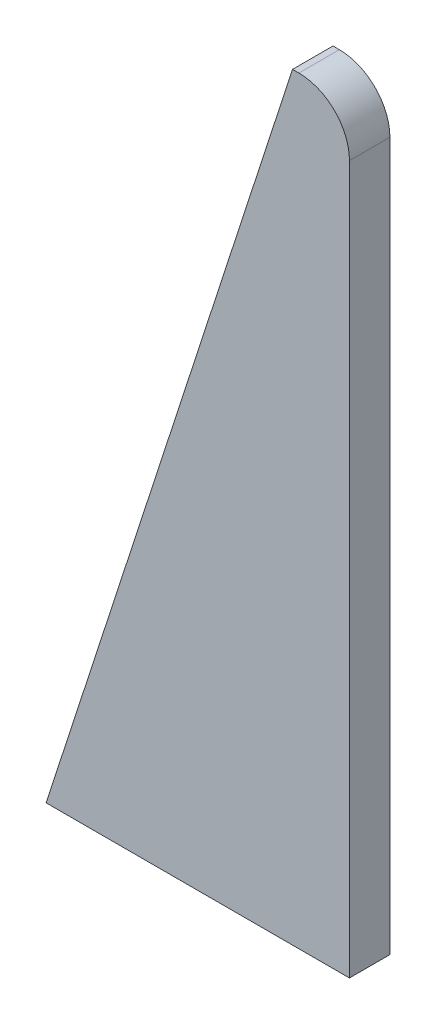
from build123d import *

# Parameters (mm, degrees)
DODANIE_WYCI_GNI_CIE1_DEPTH    = 8
OTW_R_GWINTOWANY_M5X0_81_D     = 4.2
OTW_R_GWINTOWANY_M5X0_81_DEPTH = 14
OTW_R_GWINTOWANY_M5X0_81_TIP   = 1.2618073
OTW_R_GWINTOWANY_M5X0_82_D     = 4.2
OTW_R_GWINTOWANY_M5X0_82_DEPTH = 14
OTW_R_GWINTOWANY_M5X0_82_TIP   = 1.2618073
ZAOKR_GLENIE2_R                = 10


with BuildPart() as part:
    # Szkic1 → Dodanie-wyci_gni_cie1 (new body)
    with BuildSketch(Plane.XY):
        Polygon((0, 0), (60, 0), (60, 150), (48.737954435, 150), align=None)
    extrude(amount=DODANIE_WYCI_GNI_CIE1_DEPTH)

    # Otw_r gwintowany M5x0.81
    with Locations(Plane(origin=(0, 0, 0), x_dir=(0, 0, 1), z_dir=(-0.9510565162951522, 0.3090169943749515, 0))):
        with Locations((4, 35), (4, 110)):
            Hole(OTW_R_GWINTOWANY_M5X0_81_D / 2, depth=OTW_R_GWINTOWANY_M5X0_81_DEPTH)
            with Locations((0, 0, -(OTW_R_GWINTOWANY_M5X0_81_DEPTH + OTW_R_GWINTOWANY_M5X0_81_TIP / 2))):  # 118° drill point
                Cone(0, OTW_R_GWINTOWANY_M5X0_81_D / 2, OTW_R_GWINTOWANY_M5X0_81_TIP, mode=Mode.SUBTRACT)

    # Otw_r gwintowany M5x0.82
    with Locations(Plane(origin=(0, 0, 0), x_dir=(-1, 0, 0), z_dir=(0, -1, 0))):
        with Locations((-22.5, -4), (-52.5, -4)):
            Hole(OTW_R_GWINTOWANY_M5X0_82_D / 2, depth=OTW_R_GWINTOWANY_M5X0_82_DEPTH)
            with Locations((0, 0, -(OTW_R_GWINTOWANY_M5X0_82_DEPTH + OTW_R_GWINTOWANY_M5X0_82_TIP / 2))):  # 118° drill point
                Cone(0, OTW_R_GWINTOWANY_M5X0_82_D / 2, OTW_R_GWINTOWANY_M5X0_82_TIP, mode=Mode.SUBTRACT)

    # Zaokr_glenie2
    zaokr_glenie2_edges = [part.edges().sort_by_distance(p)[0] for p in [
        (60, 150, 4),
    ]]
    fillet(zaokr_glenie2_edges, radius=ZAOKR_GLENIE2_R)


solid = part.part
